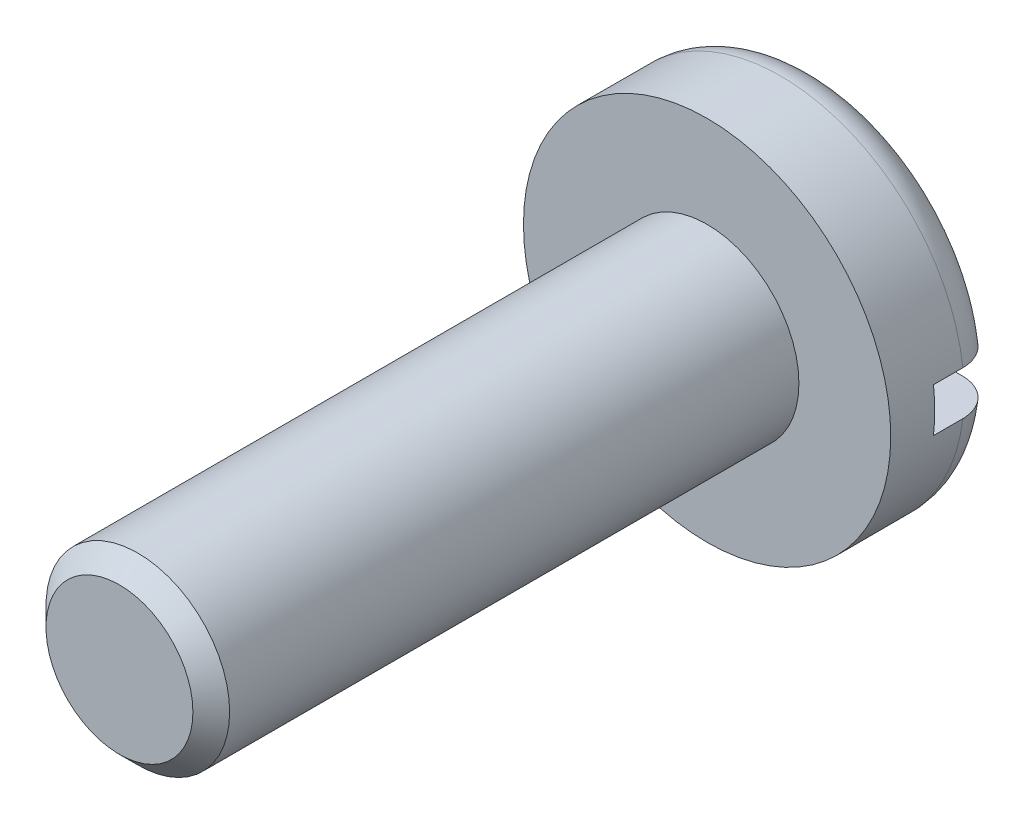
ISO-10303-21;
HEADER;
FILE_DESCRIPTION(('STEP AP214'),'2;1');
FILE_NAME('part.step','',(''),(''),'','','');
FILE_SCHEMA(('AUTOMOTIVE_DESIGN { 1 0 10303 214 1 1 1 1 }'));
ENDSEC;
DATA;
#1=APPLICATION_CONTEXT('core data for automotive mechanical design processes');
#2=APPLICATION_PROTOCOL_DEFINITION('international standard','automotive_design',2000,#1);
#3=PRODUCT_CONTEXT('',#1,'mechanical');
#4=PRODUCT('Part','Part','',(#3));
#5=PRODUCT_RELATED_PRODUCT_CATEGORY('part','',(#4));
#6=PRODUCT_DEFINITION_FORMATION('','',#4);
#7=PRODUCT_DEFINITION_CONTEXT('part definition',#1,'design');
#8=PRODUCT_DEFINITION('design','',#6,#7);
#9=PRODUCT_DEFINITION_SHAPE('','',#8);
#10=(LENGTH_UNIT() NAMED_UNIT(*) SI_UNIT(.MILLI.,.METRE.));
#11=(NAMED_UNIT(*) PLANE_ANGLE_UNIT() SI_UNIT($,.RADIAN.));
#12=(NAMED_UNIT(*) SI_UNIT($,.STERADIAN.) SOLID_ANGLE_UNIT());
#13=UNCERTAINTY_MEASURE_WITH_UNIT(LENGTH_MEASURE(1.E-05),#10,'distance_accuracy_value','');
#14=(GEOMETRIC_REPRESENTATION_CONTEXT(3) GLOBAL_UNCERTAINTY_ASSIGNED_CONTEXT((#13)) GLOBAL_UNIT_ASSIGNED_CONTEXT((#10,
#11,#12)) REPRESENTATION_CONTEXT('',''));
#15=CARTESIAN_POINT('',(0.,0.,0.));
#16=DIRECTION('',(0.,0.,1.));
#17=DIRECTION('',(1.,0.,0.));
#18=AXIS2_PLACEMENT_3D('',#15,#16,#17);
#19=CARTESIAN_POINT('',(0.,0.,-1.5));
#20=DIRECTION('',(0.,0.,1.));
#21=DIRECTION('',(1.,0.,0.));
#22=AXIS2_PLACEMENT_3D('',#19,#20,#21);
#23=PLANE('',#22);
#24=DIRECTION('',(1.,0.,0.));
#25=VECTOR('',#24,1.);
#26=CARTESIAN_POINT('',(-2.5,-0.300000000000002,-1.5));
#27=LINE('',#26,#25);
#28=CARTESIAN_POINT('',(-1.97737199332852,-0.300000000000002,-1.5));
#29=VERTEX_POINT('',#28);
#30=CARTESIAN_POINT('',(1.97737199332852,-0.3,-1.5));
#31=VERTEX_POINT('',#30);
#32=EDGE_CURVE('E162',#29,#31,#27,.T.);
#33=ORIENTED_EDGE('',*,*,#32,.T.);
#34=CARTESIAN_POINT('',(0.,0.,-1.5));
#35=DIRECTION('',(0.,0.,-1.));
#36=DIRECTION('',(-1.,0.,0.));
#37=AXIS2_PLACEMENT_3D('',#34,#35,#36);
#38=CIRCLE('',#37,2.);
#39=EDGE_CURVE('E114',#31,#29,#38,.T.);
#40=ORIENTED_EDGE('',*,*,#39,.T.);
#41=EDGE_LOOP('',(#33,#40));
#42=FACE_BOUND('',#41,.T.);
#43=ADVANCED_FACE('F33',(#42),#23,.F.);
#44=DIRECTION('',(-1.,0.,0.));
#45=VECTOR('',#44,1.);
#46=CARTESIAN_POINT('',(-2.5,0.299999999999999,-1.50000000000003));
#47=LINE('',#46,#45);
#48=CARTESIAN_POINT('',(1.97737199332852,0.3,-1.50000000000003));
#49=VERTEX_POINT('',#48);
#50=CARTESIAN_POINT('',(-1.97737199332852,0.299999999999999,-1.50000000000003));
#51=VERTEX_POINT('',#50);
#52=EDGE_CURVE('E99',#49,#51,#47,.T.);
#53=ORIENTED_EDGE('',*,*,#52,.T.);
#54=EDGE_CURVE('E110',#51,#49,#38,.T.);
#55=ORIENTED_EDGE('',*,*,#54,.T.);
#56=EDGE_LOOP('',(#53,#55));
#57=FACE_BOUND('',#56,.T.);
#58=ADVANCED_FACE('F156',(#57),#23,.F.);
#59=CARTESIAN_POINT('',(0.,0.,-1.00000000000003));
#60=DIRECTION('',(0.,0.,-1.));
#61=DIRECTION('',(-1.,0.,0.));
#62=AXIS2_PLACEMENT_3D('',#59,#60,#61);
#63=TOROIDAL_SURFACE('',#62,2.,0.5);
#64=CARTESIAN_POINT('',(-2.39275623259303,-0.300000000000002,-1.28403566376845));
#65=CARTESIAN_POINT('',(-2.40871742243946,-0.300000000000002,-1.26108979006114));
#66=CARTESIAN_POINT('',(-2.4227591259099,-0.300000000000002,-1.23678491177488));
#67=CARTESIAN_POINT('',(-2.44657688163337,-0.300000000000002,-1.18614419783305));
#68=CARTESIAN_POINT('',(-2.45634810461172,-0.300000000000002,-1.15980610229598));
#69=CARTESIAN_POINT('',(-2.47132091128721,-0.300000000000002,-1.10586746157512));
#70=CARTESIAN_POINT('',(-2.47652391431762,-0.300000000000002,-1.07826731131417));
#71=CARTESIAN_POINT('',(-2.48220908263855,-0.300000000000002,-1.02259204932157));
#72=CARTESIAN_POINT('',(-2.48269236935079,-0.300000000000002,-0.994517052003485));
#73=CARTESIAN_POINT('',(-2.4789314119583,-0.300000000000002,-0.938745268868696));
#74=CARTESIAN_POINT('',(-2.47469714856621,-0.300000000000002,-0.911047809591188));
#75=CARTESIAN_POINT('',(-2.46164113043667,-0.300000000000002,-0.856755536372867));
#76=CARTESIAN_POINT('',(-2.45281923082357,-0.300000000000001,-0.830160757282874));
#77=CARTESIAN_POINT('',(-2.43083915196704,-0.300000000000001,-0.778809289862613));
#78=CARTESIAN_POINT('',(-2.41767832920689,-0.300000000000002,-0.75405373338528));
#79=CARTESIAN_POINT('',(-2.3874045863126,-0.300000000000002,-0.707090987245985));
#80=CARTESIAN_POINT('',(-2.37029161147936,-0.300000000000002,-0.684883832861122));
#81=CARTESIAN_POINT('',(-2.33252347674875,-0.300000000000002,-0.643540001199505));
#82=CARTESIAN_POINT('',(-2.31185310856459,-0.300000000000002,-0.624417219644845));
#83=CARTESIAN_POINT('',(-2.26761601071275,-0.300000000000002,-0.589882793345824));
#84=CARTESIAN_POINT('',(-2.24404918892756,-0.300000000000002,-0.574471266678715));
#85=CARTESIAN_POINT('',(-2.19450129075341,-0.300000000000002,-0.547670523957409));
#86=CARTESIAN_POINT('',(-2.16850345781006,-0.300000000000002,-0.536312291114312));
#87=CARTESIAN_POINT('',(-2.11498123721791,-0.300000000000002,-0.518077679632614));
#88=CARTESIAN_POINT('',(-2.08745677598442,-0.300000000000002,-0.51120151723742));
#89=CARTESIAN_POINT('',(-2.03139586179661,-0.300000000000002,-0.502061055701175));
#90=CARTESIAN_POINT('',(-2.0028524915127,-0.300000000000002,-0.499839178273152));
#91=CARTESIAN_POINT('',(-1.94579410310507,-0.300000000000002,-0.500178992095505));
#92=CARTESIAN_POINT('',(-1.91727908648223,-0.300000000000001,-0.502740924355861));
#93=CARTESIAN_POINT('',(-1.86085138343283,-0.300000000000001,-0.512606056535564));
#94=CARTESIAN_POINT('',(-1.83294512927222,-0.300000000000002,-0.519946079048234));
#95=CARTESIAN_POINT('',(-1.77875489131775,-0.300000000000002,-0.53919591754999));
#96=CARTESIAN_POINT('',(-1.75247096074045,-0.300000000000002,-0.551105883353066));
#97=CARTESIAN_POINT('',(-1.70222054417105,-0.300000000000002,-0.579200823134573));
#98=CARTESIAN_POINT('',(-1.67825918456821,-0.300000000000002,-0.595394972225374));
#99=CARTESIAN_POINT('',(-1.63342077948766,-0.300000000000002,-0.631604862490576));
#100=CARTESIAN_POINT('',(-1.61254366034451,-0.300000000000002,-0.651620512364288));
#101=CARTESIAN_POINT('',(-1.57465426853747,-0.300000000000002,-0.694753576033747));
#102=CARTESIAN_POINT('',(-1.55761348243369,-0.300000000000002,-0.717845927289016));
#103=CARTESIAN_POINT('',(-1.52772834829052,-0.300000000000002,-0.766603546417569));
#104=CARTESIAN_POINT('',(-1.51488357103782,-0.300000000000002,-0.792268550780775));
#105=CARTESIAN_POINT('',(-1.49398926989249,-0.300000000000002,-0.844983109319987));
#106=CARTESIAN_POINT('',(-1.48586286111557,-0.300000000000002,-0.87200218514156));
#107=CARTESIAN_POINT('',(-1.47434461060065,-0.300000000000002,-0.927030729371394));
#108=CARTESIAN_POINT('',(-1.4709522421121,-0.300000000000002,-0.95504008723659));
#109=CARTESIAN_POINT('',(-1.46903184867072,-0.300000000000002,-1.01077570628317));
#110=CARTESIAN_POINT('',(-1.47042704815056,-0.300000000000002,-1.03849935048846));
#111=CARTESIAN_POINT('',(-1.4778655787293,-0.300000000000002,-1.09331475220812));
#112=CARTESIAN_POINT('',(-1.48390879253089,-0.300000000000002,-1.12040652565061));
#113=CARTESIAN_POINT('',(-1.50042579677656,-0.300000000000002,-1.17312973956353));
#114=CARTESIAN_POINT('',(-1.51088885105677,-0.300000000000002,-1.19876454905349));
#115=CARTESIAN_POINT('',(-1.53591625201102,-0.300000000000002,-1.24794598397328));
#116=CARTESIAN_POINT('',(-1.55048084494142,-0.300000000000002,-1.27149248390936));
#117=CARTESIAN_POINT('',(-1.58348986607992,-0.300000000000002,-1.31616342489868));
#118=CARTESIAN_POINT('',(-1.60198226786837,-0.300000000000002,-1.33725240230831));
#119=CARTESIAN_POINT('',(-1.64218916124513,-0.300000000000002,-1.3760946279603));
#120=CARTESIAN_POINT('',(-1.66390395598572,-0.300000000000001,-1.39384756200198));
#121=CARTESIAN_POINT('',(-1.71035693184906,-0.300000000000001,-1.42584129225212));
#122=CARTESIAN_POINT('',(-1.73514201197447,-0.300000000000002,-1.44001401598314));
#123=CARTESIAN_POINT('',(-1.78672025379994,-0.300000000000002,-1.46405146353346));
#124=CARTESIAN_POINT('',(-1.81351355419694,-0.300000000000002,-1.47391588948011));
#125=CARTESIAN_POINT('',(-1.8686735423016,-0.300000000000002,-1.489154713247));
#126=CARTESIAN_POINT('',(-1.89705452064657,-0.300000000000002,-1.49447744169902));
#127=CARTESIAN_POINT('',(-1.95430672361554,-0.300000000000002,-1.50028825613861));
#128=CARTESIAN_POINT('',(-1.98317793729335,-0.300000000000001,-1.50077644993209));
#129=CARTESIAN_POINT('',(-2.04061759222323,-0.300000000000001,-1.49688950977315));
#130=CARTESIAN_POINT('',(-2.06918574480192,-0.300000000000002,-1.49251009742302));
#131=CARTESIAN_POINT('',(-2.12517926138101,-0.300000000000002,-1.47898432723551));
#132=CARTESIAN_POINT('',(-2.15260437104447,-0.300000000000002,-1.46983691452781));
#133=CARTESIAN_POINT('',(-2.20534590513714,-0.300000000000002,-1.44708782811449));
#134=CARTESIAN_POINT('',(-2.23067381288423,-0.300000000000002,-1.43351274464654));
#135=CARTESIAN_POINT('',(-2.27863868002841,-0.300000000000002,-1.40227363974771));
#136=CARTESIAN_POINT('',(-2.30127897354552,-0.3,-1.38461476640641));
#137=CARTESIAN_POINT('',(-2.33540475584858,-0.300000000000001,-1.35296400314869));
#138=CARTESIAN_POINT('',(-2.34790755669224,-0.300000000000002,-1.34005040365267));
#139=CARTESIAN_POINT('',(-2.37145637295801,-0.300000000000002,-1.31295671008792));
#140=CARTESIAN_POINT('',(-2.38250239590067,-0.300000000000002,-1.29877662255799));
#141=CARTESIAN_POINT('',(-2.39275623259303,-0.300000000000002,-1.28403566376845));
#142=B_SPLINE_CURVE_WITH_KNOTS('',3,(#64,#65,#66,#67,#68,#69,#70,#71,#72,#73,#74,#75,#76,#77,
#78,#79,#80,#81,#82,#83,#84,#85,#86,#87,#88,#89,#90,#91,#92,#93,#94,#95,#96,#97,#98,#99,#100,
#101,#102,#103,#104,#105,#106,#107,#108,#109,#110,#111,#112,#113,#114,#115,#116,#117,#118,#119,
#120,#121,#122,#123,#124,#125,#126,#127,#128,#129,#130,#131,#132,#133,#134,#135,#136,#137,#138,
#139,#140,#141),.UNSPECIFIED.,.T.,.F.,(4,2,2,2,2,2,2,2,2,2,2,2,2,2,2,2,2,2,2,2,2,2,2,2,2,2,2,2,
2,2,2,2,2,2,2,2,2,2,4),(0.,0.0837885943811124,0.167671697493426,0.251528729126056,
0.335365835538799,0.419025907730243,0.502688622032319,0.586402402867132,0.670117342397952,
0.754199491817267,0.838284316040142,0.922998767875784,1.00771730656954,1.09320471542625,
1.17869643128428,1.26485492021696,1.35101623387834,1.43736358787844,1.52370887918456,
1.60938950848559,1.69506137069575,1.77929492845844,1.86351911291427,1.94639899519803,
2.02927678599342,2.11195440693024,2.19463699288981,2.27839438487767,2.36215966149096,
2.44741457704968,2.53267538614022,2.61889371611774,2.70511012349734,2.7914023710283,
2.87771371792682,2.96351598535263,3.0492106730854,3.10303867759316,3.15686640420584),.UNSPECIFIED.);
#143=CARTESIAN_POINT('',(-2.48193472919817,-0.300000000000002,-1.));
#144=VERTEX_POINT('',#143);
#145=EDGE_CURVE('E54',#29,#144,#142,.T.);
#146=ORIENTED_EDGE('',*,*,#145,.F.);
#147=ORIENTED_EDGE('',*,*,#39,.F.);
#148=CARTESIAN_POINT('',(1.51295371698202,-0.300000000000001,-1.20152293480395));
#149=CARTESIAN_POINT('',(1.50164195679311,-0.300000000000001,-1.17632539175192));
#150=CARTESIAN_POINT('',(1.49243193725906,-0.300000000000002,-1.15016423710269));
#151=CARTESIAN_POINT('',(1.47852371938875,-0.300000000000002,-1.09664823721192));
#152=CARTESIAN_POINT('',(1.47383003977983,-0.300000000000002,-1.06929222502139));
#153=CARTESIAN_POINT('',(1.46911958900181,-0.300000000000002,-1.01418191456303));
#154=CARTESIAN_POINT('',(1.46910208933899,-0.300000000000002,-0.986427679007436));
#155=CARTESIAN_POINT('',(1.47374385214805,-0.300000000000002,-0.93132004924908));
#156=CARTESIAN_POINT('',(1.47840213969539,-0.300000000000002,-0.903966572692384));
#157=CARTESIAN_POINT('',(1.49222068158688,-0.300000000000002,-0.850505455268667));
#158=CARTESIAN_POINT('',(1.50136823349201,-0.300000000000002,-0.824394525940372));
#159=CARTESIAN_POINT('',(1.52387003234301,-0.300000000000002,-0.77405333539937));
#160=CARTESIAN_POINT('',(1.53722462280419,-0.300000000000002,-0.749823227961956));
#161=CARTESIAN_POINT('',(1.56790637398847,-0.300000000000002,-0.703634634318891));
#162=CARTESIAN_POINT('',(1.58527611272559,-0.300000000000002,-0.681704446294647));
#163=CARTESIAN_POINT('',(1.62339117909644,-0.300000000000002,-0.641006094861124));
#164=CARTESIAN_POINT('',(1.64413681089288,-0.300000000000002,-0.622238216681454));
#165=CARTESIAN_POINT('',(1.68881591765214,-0.300000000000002,-0.58804493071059));
#166=CARTESIAN_POINT('',(1.7127998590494,-0.300000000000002,-0.572685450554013));
#167=CARTESIAN_POINT('',(1.76298083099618,-0.300000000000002,-0.546151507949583));
#168=CARTESIAN_POINT('',(1.7891780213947,-0.300000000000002,-0.534977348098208));
#169=CARTESIAN_POINT('',(1.8434013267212,-0.300000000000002,-0.51699982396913));
#170=CARTESIAN_POINT('',(1.87144638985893,-0.300000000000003,-0.510253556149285));
#171=CARTESIAN_POINT('',(1.92827077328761,-0.300000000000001,-0.501551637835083));
#172=CARTESIAN_POINT('',(1.95705011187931,-0.3,-0.499596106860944));
#173=CARTESIAN_POINT('',(2.01460044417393,-0.3,-0.500543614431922));
#174=CARTESIAN_POINT('',(2.04337124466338,-0.300000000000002,-0.503458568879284));
#175=CARTESIAN_POINT('',(2.1000081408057,-0.300000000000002,-0.514104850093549));
#176=CARTESIAN_POINT('',(2.12787425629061,-0.3,-0.521836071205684));
#177=CARTESIAN_POINT('',(2.18174184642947,-0.3,-0.541856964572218));
#178=CARTESIAN_POINT('',(2.20775283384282,-0.300000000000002,-0.554121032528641));
#179=CARTESIAN_POINT('',(2.25732057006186,-0.300000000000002,-0.582880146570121));
#180=CARTESIAN_POINT('',(2.28087742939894,-0.300000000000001,-0.599375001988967));
#181=CARTESIAN_POINT('',(2.32464265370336,-0.300000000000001,-0.635969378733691));
#182=CARTESIAN_POINT('',(2.34487911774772,-0.300000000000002,-0.656035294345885));
#183=CARTESIAN_POINT('',(2.38166035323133,-0.300000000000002,-0.699305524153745));
#184=CARTESIAN_POINT('',(2.39820529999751,-0.300000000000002,-0.72250968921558));
#185=CARTESIAN_POINT('',(2.42698667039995,-0.300000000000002,-0.771182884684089));
#186=CARTESIAN_POINT('',(2.43925877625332,-0.300000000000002,-0.796630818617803));
#187=CARTESIAN_POINT('',(2.45932706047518,-0.300000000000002,-0.849234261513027));
#188=CARTESIAN_POINT('',(2.46712340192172,-0.300000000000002,-0.876389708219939));
#189=CARTESIAN_POINT('',(2.47797597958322,-0.300000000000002,-0.931462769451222));
#190=CARTESIAN_POINT('',(2.48106025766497,-0.300000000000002,-0.95937486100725));
#191=CARTESIAN_POINT('',(2.48248663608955,-0.300000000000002,-1.01531971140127));
#192=CARTESIAN_POINT('',(2.48082882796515,-0.300000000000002,-1.04335246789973));
#193=CARTESIAN_POINT('',(2.47282971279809,-0.300000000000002,-1.09867291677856));
#194=CARTESIAN_POINT('',(2.46649956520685,-0.300000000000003,-1.12596222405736));
#195=CARTESIAN_POINT('',(2.44935421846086,-0.300000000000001,-1.17909306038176));
#196=CARTESIAN_POINT('',(2.43853901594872,-0.3,-1.20493458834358));
#197=CARTESIAN_POINT('',(2.4127193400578,-0.3,-1.25448123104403));
#198=CARTESIAN_POINT('',(2.39770859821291,-0.300000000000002,-1.27818307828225));
#199=CARTESIAN_POINT('',(2.36394008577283,-0.300000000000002,-1.32274666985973));
#200=CARTESIAN_POINT('',(2.34518224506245,-0.3,-1.3436083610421));
#201=CARTESIAN_POINT('',(2.3043522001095,-0.3,-1.38201875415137));
#202=CARTESIAN_POINT('',(2.28226337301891,-0.300000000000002,-1.39954978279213));
#203=CARTESIAN_POINT('',(2.23547558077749,-0.300000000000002,-1.43068910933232));
#204=CARTESIAN_POINT('',(2.21077651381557,-0.3,-1.44429725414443));
#205=CARTESIAN_POINT('',(2.15925900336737,-0.3,-1.46732332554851));
#206=CARTESIAN_POINT('',(2.13242515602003,-0.300000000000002,-1.4767067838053));
#207=CARTESIAN_POINT('',(2.07757090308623,-0.300000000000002,-1.49088058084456));
#208=CARTESIAN_POINT('',(2.04955043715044,-0.300000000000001,-1.49567068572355));
#209=CARTESIAN_POINT('',(1.99284573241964,-0.300000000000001,-1.50056541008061));
#210=CARTESIAN_POINT('',(1.96415777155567,-0.300000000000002,-1.50062692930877));
#211=CARTESIAN_POINT('',(1.90717349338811,-0.300000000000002,-1.49596835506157));
#212=CARTESIAN_POINT('',(1.87887718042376,-0.300000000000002,-1.49124820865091));
#213=CARTESIAN_POINT('',(1.82327468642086,-0.300000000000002,-1.47711555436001));
#214=CARTESIAN_POINT('',(1.79597660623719,-0.300000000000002,-1.46767115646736));
#215=CARTESIAN_POINT('',(1.74334396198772,-0.300000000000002,-1.44433233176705));
#216=CARTESIAN_POINT('',(1.71800992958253,-0.300000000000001,-1.43043670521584));
#217=CARTESIAN_POINT('',(1.67002830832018,-0.300000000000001,-1.39856652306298));
#218=CARTESIAN_POINT('',(1.64738261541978,-0.300000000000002,-1.38058911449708));
#219=CARTESIAN_POINT('',(1.6054902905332,-0.300000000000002,-1.34106460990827));
#220=CARTESIAN_POINT('',(1.58623945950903,-0.3,-1.31952198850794));
#221=CARTESIAN_POINT('',(1.55792919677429,-0.300000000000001,-1.28177033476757));
#222=CARTESIAN_POINT('',(1.54769403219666,-0.300000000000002,-1.26642830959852));
#223=CARTESIAN_POINT('',(1.52897880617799,-0.300000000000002,-1.23470806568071));
#224=CARTESIAN_POINT('',(1.52049873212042,-0.300000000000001,-1.21832985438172));
#225=CARTESIAN_POINT('',(1.51295371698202,-0.300000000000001,-1.20152293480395));
#226=B_SPLINE_CURVE_WITH_KNOTS('',3,(#148,#149,#150,#151,#152,#153,#154,#155,#156,#157,#158,
#159,#160,#161,#162,#163,#164,#165,#166,#167,#168,#169,#170,#171,#172,#173,#174,#175,#176,#177,
#178,#179,#180,#181,#182,#183,#184,#185,#186,#187,#188,#189,#190,#191,#192,#193,#194,#195,#196,
#197,#198,#199,#200,#201,#202,#203,#204,#205,#206,#207,#208,#209,#210,#211,#212,#213,#214,#215,
#216,#217,#218,#219,#220,#221,#222,#223,#224,#225),.UNSPECIFIED.,.T.,.F.,(4,2,2,2,2,2,2,2,2,2,2,
2,2,2,2,2,2,2,2,2,2,2,2,2,2,2,2,2,2,2,2,2,2,2,2,2,2,2,4),(0.,0.0827941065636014,
0.165670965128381,0.248534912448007,0.331381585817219,0.413995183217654,0.496615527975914,
0.580155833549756,0.663703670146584,0.748748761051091,0.833799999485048,0.919927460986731,
1.00605707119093,1.0923977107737,1.17873645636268,1.26459478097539,1.35044923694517,
1.43553479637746,1.52061631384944,1.60496924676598,1.68931910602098,1.77316500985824,
1.8570092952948,1.94065397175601,2.02429871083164,2.10806909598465,2.19184104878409,
2.27604580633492,2.36025384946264,2.44513700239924,2.53002447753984,2.61568559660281,
2.70134766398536,2.78759593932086,2.87386748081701,2.96019950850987,3.04642399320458,
3.10164857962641,3.1568727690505),.UNSPECIFIED.);
#227=CARTESIAN_POINT('',(2.48193472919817,-0.300000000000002,-1.));
#228=VERTEX_POINT('',#227);
#229=EDGE_CURVE('E126',#228,#31,#226,.T.);
#230=ORIENTED_EDGE('',*,*,#229,.F.);
#231=CARTESIAN_POINT('',(0.,0.,-1.00000000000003));
#232=DIRECTION('',(0.,0.,-1.));
#233=DIRECTION('',(-1.,0.,0.));
#234=AXIS2_PLACEMENT_3D('',#231,#232,#233);
#235=CIRCLE('',#234,2.5);
#236=EDGE_CURVE('E121',#228,#144,#235,.T.);
#237=ORIENTED_EDGE('',*,*,#236,.T.);
#238=EDGE_LOOP('',(#146,#147,#230,#237));
#239=FACE_BOUND('',#238,.T.);
#240=ADVANCED_FACE('F134',(#239),#63,.T.);
#241=CARTESIAN_POINT('',(-2.39275623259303,0.299999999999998,-1.28403566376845));
#242=CARTESIAN_POINT('',(-2.3766366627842,0.299999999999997,-1.30720477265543));
#243=CARTESIAN_POINT('',(-2.35853609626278,0.299999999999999,-1.3290219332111));
#244=CARTESIAN_POINT('',(-2.31890561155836,0.300000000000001,-1.36931696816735));
#245=CARTESIAN_POINT('',(-2.29737130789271,0.3,-1.38779050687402));
#246=CARTESIAN_POINT('',(-2.25152834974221,0.3,-1.42085294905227));
#247=CARTESIAN_POINT('',(-2.22722204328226,0.3,-1.43544510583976));
#248=CARTESIAN_POINT('',(-2.17652432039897,0.299999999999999,-1.46036713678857));
#249=CARTESIAN_POINT('',(-2.15013341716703,0.299999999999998,-1.47069805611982));
#250=CARTESIAN_POINT('',(-2.09582564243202,0.299999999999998,-1.48688942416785));
#251=CARTESIAN_POINT('',(-2.06789989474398,0.299999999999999,-1.49272009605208));
#252=CARTESIAN_POINT('',(-2.01146649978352,0.3,-1.49965496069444));
#253=CARTESIAN_POINT('',(-1.98295879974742,0.3,-1.50075872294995));
#254=CARTESIAN_POINT('',(-1.92590693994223,0.3,-1.49821232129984));
#255=CARTESIAN_POINT('',(-1.8973646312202,0.3,-1.49452060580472));
#256=CARTESIAN_POINT('',(-1.84129666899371,0.3,-1.48242263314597));
#257=CARTESIAN_POINT('',(-1.81377105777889,0.299999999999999,-1.47401618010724));
#258=CARTESIAN_POINT('',(-1.76037992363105,0.299999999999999,-1.45266949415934));
#259=CARTESIAN_POINT('',(-1.73452319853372,0.3,-1.43970724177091));
#260=CARTESIAN_POINT('',(-1.6853618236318,0.3,-1.40961139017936));
#261=CARTESIAN_POINT('',(-1.6620571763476,0.3,-1.39247778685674));
#262=CARTESIAN_POINT('',(-1.61876589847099,0.3,-1.35457576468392));
#263=CARTESIAN_POINT('',(-1.59876763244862,0.3,-1.333820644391));
#264=CARTESIAN_POINT('',(-1.56259822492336,0.3,-1.28920623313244));
#265=CARTESIAN_POINT('',(-1.54642680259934,0.299999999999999,-1.26534717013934));
#266=CARTESIAN_POINT('',(-1.51862309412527,0.299999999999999,-1.21555278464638));
#267=CARTESIAN_POINT('',(-1.50693057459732,0.3,-1.18965110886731));
#268=CARTESIAN_POINT('',(-1.48815094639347,0.3,-1.13622899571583));
#269=CARTESIAN_POINT('',(-1.48106327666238,0.3,-1.10870875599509));
#270=CARTESIAN_POINT('',(-1.4718163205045,0.3,-1.0533607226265));
#271=CARTESIAN_POINT('',(-1.46957093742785,0.3,-1.02554729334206));
#272=CARTESIAN_POINT('',(-1.46982713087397,0.3,-0.969943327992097));
#273=CARTESIAN_POINT('',(-1.47232840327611,0.299999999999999,-0.942152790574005));
#274=CARTESIAN_POINT('',(-1.48195137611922,0.299999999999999,-0.887634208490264));
#275=CARTESIAN_POINT('',(-1.48903285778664,0.3,-0.860899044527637));
#276=CARTESIAN_POINT('',(-1.50754942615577,0.3,-0.808982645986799));
#277=CARTESIAN_POINT('',(-1.51898465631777,0.3,-0.78380146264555));
#278=CARTESIAN_POINT('',(-1.54596094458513,0.3,-0.735485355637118));
#279=CARTESIAN_POINT('',(-1.56153353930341,0.3,-0.7123680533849));
#280=CARTESIAN_POINT('',(-1.59627591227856,0.3,-0.669017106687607));
#281=CARTESIAN_POINT('',(-1.61544600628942,0.299999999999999,-0.648783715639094));
#282=CARTESIAN_POINT('',(-1.65719975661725,0.299999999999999,-0.611398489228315));
#283=CARTESIAN_POINT('',(-1.67983740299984,0.3,-0.594306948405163));
#284=CARTESIAN_POINT('',(-1.72762667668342,0.3,-0.56410115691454));
#285=CARTESIAN_POINT('',(-1.75277850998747,0.3,-0.55098723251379));
#286=CARTESIAN_POINT('',(-1.80528190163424,0.3,-0.52892175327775));
#287=CARTESIAN_POINT('',(-1.83266027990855,0.3,-0.520033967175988));
#288=CARTESIAN_POINT('',(-1.88851740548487,0.299999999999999,-0.506955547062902));
#289=CARTESIAN_POINT('',(-1.91699619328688,0.299999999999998,-0.502765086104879));
#290=CARTESIAN_POINT('',(-1.97439273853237,0.299999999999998,-0.499197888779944));
#291=CARTESIAN_POINT('',(-2.00331194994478,0.299999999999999,-0.499844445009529));
#292=CARTESIAN_POINT('',(-2.06062804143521,0.3,-0.506003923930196));
#293=CARTESIAN_POINT('',(-2.08902492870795,0.3,-0.511516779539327));
#294=CARTESIAN_POINT('',(-2.14436262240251,0.3,-0.527238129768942));
#295=CARTESIAN_POINT('',(-2.17130892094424,0.3,-0.537427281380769));
#296=CARTESIAN_POINT('',(-2.22308657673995,0.3,-0.562223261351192));
#297=CARTESIAN_POINT('',(-2.24791801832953,0.299999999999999,-0.576829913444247));
#298=CARTESIAN_POINT('',(-2.29453266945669,0.3,-0.609913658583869));
#299=CARTESIAN_POINT('',(-2.31634016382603,0.3,-0.628356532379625));
#300=CARTESIAN_POINT('',(-2.35651448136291,0.3,-0.668671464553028));
#301=CARTESIAN_POINT('',(-2.37488146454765,0.299999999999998,-0.690543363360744));
#302=CARTESIAN_POINT('',(-2.4074821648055,0.299999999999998,-0.73688533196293));
#303=CARTESIAN_POINT('',(-2.42175116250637,0.299999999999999,-0.761330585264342));
#304=CARTESIAN_POINT('',(-2.44594990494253,0.3,-0.812280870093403));
#305=CARTESIAN_POINT('',(-2.45587999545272,0.3,-0.838785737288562));
#306=CARTESIAN_POINT('',(-2.47105459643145,0.3,-0.892909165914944));
#307=CARTESIAN_POINT('',(-2.47633053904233,0.3,-0.920518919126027));
#308=CARTESIAN_POINT('',(-2.48215636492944,0.299999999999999,-0.976240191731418));
#309=CARTESIAN_POINT('',(-2.48270516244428,0.299999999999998,-1.00435182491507));
#310=CARTESIAN_POINT('',(-2.47906445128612,0.299999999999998,-1.06018488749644));
#311=CARTESIAN_POINT('',(-2.47488810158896,0.3,-1.08790718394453));
#312=CARTESIAN_POINT('',(-2.46194244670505,0.3,-1.1422328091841));
#313=CARTESIAN_POINT('',(-2.45317878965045,0.299999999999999,-1.16883747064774));
#314=CARTESIAN_POINT('',(-2.43557271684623,0.299999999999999,-1.21022598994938));
#315=CARTESIAN_POINT('',(-2.42807592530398,0.3,-1.22559659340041));
#316=CARTESIAN_POINT('',(-2.41154682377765,0.3,-1.25548850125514));
#317=CARTESIAN_POINT('',(-2.40251451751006,0.299999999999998,-1.27000980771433));
#318=CARTESIAN_POINT('',(-2.39275623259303,0.299999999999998,-1.28403566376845));
#319=B_SPLINE_CURVE_WITH_KNOTS('',3,(#241,#242,#243,#244,#245,#246,#247,#248,#249,#250,#251,
#252,#253,#254,#255,#256,#257,#258,#259,#260,#261,#262,#263,#264,#265,#266,#267,#268,#269,#270,
#271,#272,#273,#274,#275,#276,#277,#278,#279,#280,#281,#282,#283,#284,#285,#286,#287,#288,#289,
#290,#291,#292,#293,#294,#295,#296,#297,#298,#299,#300,#301,#302,#303,#304,#305,#306,#307,#308,
#309,#310,#311,#312,#313,#314,#315,#316,#317,#318),.UNSPECIFIED.,.T.,.F.,(4,2,2,2,2,2,2,2,2,2,2,
2,2,2,2,2,2,2,2,2,2,2,2,2,2,2,2,2,2,2,2,2,2,2,2,2,2,2,4),(0.,0.0846118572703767,
0.169332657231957,0.253982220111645,0.338611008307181,0.423795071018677,0.508986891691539,
0.594921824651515,0.680860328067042,0.76722004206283,0.853579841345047,0.939628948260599,
1.02567173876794,1.11051298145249,1.19534388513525,1.27865360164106,1.36195798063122,
1.4445406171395,1.52712597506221,1.61035984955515,1.69360103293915,1.77830268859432,
1.86301129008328,1.94896041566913,2.03491270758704,2.12127916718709,2.20764443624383,
2.29365564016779,2.37966341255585,2.46493458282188,2.55020178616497,2.63471124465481,
2.71921396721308,2.80314152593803,2.88708836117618,2.97080198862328,3.05441278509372,
3.10563428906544,3.15685566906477),.UNSPECIFIED.);
#320=CARTESIAN_POINT('',(-2.48193472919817,0.3,-1.));
#321=VERTEX_POINT('',#320);
#322=EDGE_CURVE('E167',#321,#51,#319,.T.);
#323=ORIENTED_EDGE('',*,*,#322,.F.);
#324=CARTESIAN_POINT('',(2.48193472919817,0.299999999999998,-1.));
#325=VERTEX_POINT('',#324);
#326=EDGE_CURVE('E119',#321,#325,#235,.T.);
#327=ORIENTED_EDGE('',*,*,#326,.T.);
#328=CARTESIAN_POINT('',(1.51295371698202,0.3,-1.20152293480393));
#329=CARTESIAN_POINT('',(1.52452760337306,0.3,-1.22729808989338));
#330=CARTESIAN_POINT('',(1.53831827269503,0.3,-1.25210269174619));
#331=CARTESIAN_POINT('',(1.56989783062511,0.299999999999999,-1.29905284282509));
#332=CARTESIAN_POINT('',(1.58769235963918,0.299999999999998,-1.32119457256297));
#333=CARTESIAN_POINT('',(1.62670934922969,0.299999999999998,-1.36216736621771));
#334=CARTESIAN_POINT('',(1.64792762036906,0.299999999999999,-1.38100241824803));
#335=CARTESIAN_POINT('',(1.69318518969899,0.3,-1.41488822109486));
#336=CARTESIAN_POINT('',(1.71722377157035,0.3,-1.42993992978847));
#337=CARTESIAN_POINT('',(1.76775652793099,0.3,-1.45602798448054));
#338=CARTESIAN_POINT('',(1.79427671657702,0.3,-1.46701395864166));
#339=CARTESIAN_POINT('',(1.8487782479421,0.3,-1.48441559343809));
#340=CARTESIAN_POINT('',(1.87675972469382,0.3,-1.49083083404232));
#341=CARTESIAN_POINT('',(1.93360878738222,0.3,-1.49893788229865));
#342=CARTESIAN_POINT('',(1.96248135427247,0.3,-1.50059483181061));
#343=CARTESIAN_POINT('',(2.02009421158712,0.3,-1.49902645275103));
#344=CARTESIAN_POINT('',(2.04883450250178,0.299999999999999,-1.49580114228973));
#345=CARTESIAN_POINT('',(2.10529197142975,0.3,-1.48455545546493));
#346=CARTESIAN_POINT('',(2.13301139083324,0.3,-1.47654634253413));
#347=CARTESIAN_POINT('',(2.18669482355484,0.3,-1.45595107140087));
#348=CARTESIAN_POINT('',(2.21265890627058,0.299999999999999,-1.44336509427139));
#349=CARTESIAN_POINT('',(2.26187268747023,0.299999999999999,-1.4140772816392));
#350=CARTESIAN_POINT('',(2.28514227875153,0.3,-1.39740887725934));
#351=CARTESIAN_POINT('',(2.32851967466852,0.3,-1.36036870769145));
#352=CARTESIAN_POINT('',(2.3486276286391,0.3,-1.33999711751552));
#353=CARTESIAN_POINT('',(2.38491736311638,0.299999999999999,-1.29632933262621));
#354=CARTESIAN_POINT('',(2.40113325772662,0.3,-1.27306148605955));
#355=CARTESIAN_POINT('',(2.42939438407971,0.3,-1.22411745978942));
#356=CARTESIAN_POINT('',(2.44143979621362,0.3,-1.19844138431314));
#357=CARTESIAN_POINT('',(2.46092908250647,0.3,-1.14561409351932));
#358=CARTESIAN_POINT('',(2.46840622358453,0.3,-1.11847514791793));
#359=CARTESIAN_POINT('',(2.47867699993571,0.3,-1.06332515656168));
#360=CARTESIAN_POINT('',(2.48147076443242,0.3,-1.03531413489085));
#361=CARTESIAN_POINT('',(2.48229055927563,0.3,-0.979338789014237));
#362=CARTESIAN_POINT('',(2.48033625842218,0.3,-0.951374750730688));
#363=CARTESIAN_POINT('',(2.47175867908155,0.3,-0.896172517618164));
#364=CARTESIAN_POINT('',(2.46513544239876,0.3,-0.868934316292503));
#365=CARTESIAN_POINT('',(2.44741716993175,0.3,-0.815963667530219));
#366=CARTESIAN_POINT('',(2.43632356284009,0.3,-0.790230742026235));
#367=CARTESIAN_POINT('',(2.40998810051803,0.3,-0.740983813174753));
#368=CARTESIAN_POINT('',(2.39474620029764,0.299999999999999,-0.717469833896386));
#369=CARTESIAN_POINT('',(2.36049462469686,0.299999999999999,-0.67323606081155));
#370=CARTESIAN_POINT('',(2.34147191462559,0.3,-0.652526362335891));
#371=CARTESIAN_POINT('',(2.30024067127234,0.3,-0.614568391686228));
#372=CARTESIAN_POINT('',(2.27803204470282,0.299999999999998,-0.597320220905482));
#373=CARTESIAN_POINT('',(2.23089955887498,0.299999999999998,-0.566645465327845));
#374=CARTESIAN_POINT('',(2.20595818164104,0.3,-0.553245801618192));
#375=CARTESIAN_POINT('',(2.15419440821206,0.3,-0.530782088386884));
#376=CARTESIAN_POINT('',(2.12737192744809,0.299999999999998,-0.521718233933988));
#377=CARTESIAN_POINT('',(2.07235272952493,0.299999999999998,-0.508097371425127));
#378=CARTESIAN_POINT('',(2.0441459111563,0.299999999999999,-0.503581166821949));
#379=CARTESIAN_POINT('',(1.98737407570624,0.3,-0.499305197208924));
#380=CARTESIAN_POINT('',(1.95880904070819,0.3,-0.49954567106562));
#381=CARTESIAN_POINT('',(1.90187459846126,0.3,-0.504785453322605));
#382=CARTESIAN_POINT('',(1.87350889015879,0.3,-0.509825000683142));
#383=CARTESIAN_POINT('',(1.81801805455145,0.3,-0.524574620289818));
#384=CARTESIAN_POINT('',(1.79089297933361,0.299999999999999,-0.534284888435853));
#385=CARTESIAN_POINT('',(1.73854574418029,0.299999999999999,-0.558156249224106));
#386=CARTESIAN_POINT('',(1.71333157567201,0.3,-0.572334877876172));
#387=CARTESIAN_POINT('',(1.66565582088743,0.3,-0.604743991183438));
#388=CARTESIAN_POINT('',(1.6431942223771,0.3,-0.622974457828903));
#389=CARTESIAN_POINT('',(1.60179845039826,0.3,-0.662886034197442));
#390=CARTESIAN_POINT('',(1.58284699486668,0.3,-0.684549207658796));
#391=CARTESIAN_POINT('',(1.54891708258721,0.3,-0.730790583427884));
#392=CARTESIAN_POINT('',(1.53393812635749,0.3,-0.75536841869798));
#393=CARTESIAN_POINT('',(1.50863022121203,0.3,-0.806344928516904));
#394=CARTESIAN_POINT('',(1.49823384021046,0.3,-0.832710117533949));
#395=CARTESIAN_POINT('',(1.48210216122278,0.3,-0.886837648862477));
#396=CARTESIAN_POINT('',(1.47636750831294,0.3,-0.914600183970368));
#397=CARTESIAN_POINT('',(1.46981262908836,0.3,-0.970217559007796));
#398=CARTESIAN_POINT('',(1.46891064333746,0.3,-0.998062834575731));
#399=CARTESIAN_POINT('',(1.47183363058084,0.3,-1.05347947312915));
#400=CARTESIAN_POINT('',(1.47565247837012,0.299999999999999,-1.08105114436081));
#401=CARTESIAN_POINT('',(1.48538142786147,0.3,-1.12413018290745));
#402=CARTESIAN_POINT('',(1.48981103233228,0.3,-1.13998694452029));
#403=CARTESIAN_POINT('',(1.50022785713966,0.3,-1.1711797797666));
#404=CARTESIAN_POINT('',(1.5062150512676,0.3,-1.18651586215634));
#405=CARTESIAN_POINT('',(1.51295371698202,0.3,-1.20152293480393));
#406=B_SPLINE_CURVE_WITH_KNOTS('',3,(#328,#329,#330,#331,#332,#333,#334,#335,#336,#337,#338,
#339,#340,#341,#342,#343,#344,#345,#346,#347,#348,#349,#350,#351,#352,#353,#354,#355,#356,#357,
#358,#359,#360,#361,#362,#363,#364,#365,#366,#367,#368,#369,#370,#371,#372,#373,#374,#375,#376,
#377,#378,#379,#380,#381,#382,#383,#384,#385,#386,#387,#388,#389,#390,#391,#392,#393,#394,#395,
#396,#397,#398,#399,#400,#401,#402,#403,#404,#405),.UNSPECIFIED.,.T.,.F.,(4,2,2,2,2,2,2,2,2,2,2,
2,2,2,2,2,2,2,2,2,2,2,2,2,2,2,2,2,2,2,2,2,2,2,2,2,2,2,4),(0.,0.0847019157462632,
0.169523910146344,0.254242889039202,0.33894039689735,0.424654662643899,0.510376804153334,
0.596725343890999,0.683073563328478,0.769219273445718,0.855361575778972,0.940820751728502,
1.02627588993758,1.11095216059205,1.19562476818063,1.27967318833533,1.36371928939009,
1.4474178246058,1.53111561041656,1.61478666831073,1.69845863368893,1.78242423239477,
1.86639229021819,1.95093416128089,2.0354798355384,2.12077750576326,2.20607945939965,
2.29210300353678,2.3781301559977,2.46449921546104,2.55086789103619,2.63679932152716,
2.72271994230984,2.8073302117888,2.89195218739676,2.97513789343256,3.05821578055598,
3.10753262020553,3.15684863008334),.UNSPECIFIED.);
#407=EDGE_CURVE('E168',#49,#325,#406,.T.);
#408=ORIENTED_EDGE('',*,*,#407,.F.);
#409=ORIENTED_EDGE('',*,*,#54,.F.);
#410=EDGE_LOOP('',(#323,#327,#408,#409));
#411=FACE_BOUND('',#410,.T.);
#412=ADVANCED_FACE('F149',(#411),#63,.T.);
#413=CARTESIAN_POINT('',(0.,0.,0.));
#414=DIRECTION('',(0.,0.,-1.));
#415=DIRECTION('',(-1.,0.,0.));
#416=AXIS2_PLACEMENT_3D('',#413,#414,#415);
#417=CYLINDRICAL_SURFACE('',#416,2.5);
#418=CARTESIAN_POINT('',(0.,0.,0.));
#419=DIRECTION('',(0.,0.,-1.));
#420=DIRECTION('',(-1.,0.,0.));
#421=AXIS2_PLACEMENT_3D('',#418,#419,#420);
#422=CIRCLE('',#421,2.5);
#423=CARTESIAN_POINT('',(-2.5,0.,0.));
#424=VERTEX_POINT('',#423);
#425=EDGE_CURVE('E123',#424,#424,#422,.T.);
#426=ORIENTED_EDGE('',*,*,#425,.T.);
#427=EDGE_LOOP('',(#426));
#428=FACE_BOUND('',#427,.T.);
#429=DIRECTION('',(0.,0.,-1.));
#430=VECTOR('',#429,1.);
#431=CARTESIAN_POINT('',(-2.48193472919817,-0.300000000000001,0.));
#432=LINE('',#431,#430);
#433=CARTESIAN_POINT('',(-2.48193472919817,-0.300000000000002,-0.599999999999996));
#434=VERTEX_POINT('',#433);
#435=EDGE_CURVE('E82',#144,#434,#432,.F.);
#436=ORIENTED_EDGE('',*,*,#435,.F.);
#437=ORIENTED_EDGE('',*,*,#236,.F.);
#438=DIRECTION('',(0.,0.,-1.));
#439=VECTOR('',#438,1.);
#440=CARTESIAN_POINT('',(2.48193472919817,-0.300000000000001,0.));
#441=LINE('',#440,#439);
#442=CARTESIAN_POINT('',(2.48193472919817,-0.300000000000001,-0.600000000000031));
#443=VERTEX_POINT('',#442);
#444=EDGE_CURVE('E47',#443,#228,#441,.T.);
#445=ORIENTED_EDGE('',*,*,#444,.F.);
#446=CARTESIAN_POINT('',(0.,0.,-0.600000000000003));
#447=DIRECTION('',(0.,0.,1.));
#448=DIRECTION('',(1.,0.,0.));
#449=AXIS2_PLACEMENT_3D('',#446,#447,#448);
#450=CIRCLE('',#449,2.5);
#451=CARTESIAN_POINT('',(2.48193472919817,0.299999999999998,-0.600000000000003));
#452=VERTEX_POINT('',#451);
#453=EDGE_CURVE('E97',#443,#452,#450,.T.);
#454=ORIENTED_EDGE('',*,*,#453,.T.);
#455=DIRECTION('',(0.,0.,-1.));
#456=VECTOR('',#455,1.);
#457=CARTESIAN_POINT('',(2.48193472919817,0.299999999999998,0.));
#458=LINE('',#457,#456);
#459=EDGE_CURVE('E106',#325,#452,#458,.F.);
#460=ORIENTED_EDGE('',*,*,#459,.F.);
#461=ORIENTED_EDGE('',*,*,#326,.F.);
#462=DIRECTION('',(0.,0.,-1.));
#463=VECTOR('',#462,1.);
#464=CARTESIAN_POINT('',(-2.48193472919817,0.3,0.));
#465=LINE('',#464,#463);
#466=CARTESIAN_POINT('',(-2.48193472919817,0.3,-0.600000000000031));
#467=VERTEX_POINT('',#466);
#468=EDGE_CURVE('E90',#467,#321,#465,.T.);
#469=ORIENTED_EDGE('',*,*,#468,.F.);
#470=EDGE_CURVE('E95',#467,#434,#450,.T.);
#471=ORIENTED_EDGE('',*,*,#470,.T.);
#472=EDGE_LOOP('',(#436,#437,#445,#454,#460,#461,#469,#471));
#473=FACE_BOUND('',#472,.T.);
#474=ADVANCED_FACE('F102',(#428,#473),#417,.T.);
#475=CARTESIAN_POINT('',(0.,0.,0.));
#476=DIRECTION('',(0.,0.,-1.));
#477=DIRECTION('',(-1.,0.,0.));
#478=AXIS2_PLACEMENT_3D('',#475,#476,#477);
#479=PLANE('',#478);
#480=CARTESIAN_POINT('',(0.,0.,0.));
#481=DIRECTION('',(0.,0.,1.));
#482=DIRECTION('',(1.,0.,0.));
#483=AXIS2_PLACEMENT_3D('',#480,#481,#482);
#484=CIRCLE('',#483,1.25);
#485=CARTESIAN_POINT('',(1.25,0.,0.));
#486=VERTEX_POINT('',#485);
#487=EDGE_CURVE('E164',#486,#486,#484,.T.);
#488=ORIENTED_EDGE('',*,*,#487,.F.);
#489=EDGE_LOOP('',(#488));
#490=FACE_BOUND('',#489,.T.);
#491=ORIENTED_EDGE('',*,*,#425,.F.);
#492=EDGE_LOOP('',(#491));
#493=FACE_BOUND('',#492,.T.);
#494=ADVANCED_FACE('F142',(#490,#493),#479,.F.);
#495=CARTESIAN_POINT('',(-2.5,-0.300000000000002,-0.599999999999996));
#496=DIRECTION('',(0.,1.,0.));
#497=DIRECTION('',(0.,0.,1.));
#498=AXIS2_PLACEMENT_3D('',#495,#496,#497);
#499=PLANE('',#498);
#500=ORIENTED_EDGE('',*,*,#229,.T.);
#501=ORIENTED_EDGE('',*,*,#32,.F.);
#502=ORIENTED_EDGE('',*,*,#145,.T.);
#503=ORIENTED_EDGE('',*,*,#435,.T.);
#504=DIRECTION('',(1.,0.,0.));
#505=VECTOR('',#504,1.);
#506=CARTESIAN_POINT('',(-2.5,-0.300000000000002,-0.599999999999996));
#507=LINE('',#506,#505);
#508=EDGE_CURVE('E85',#434,#443,#507,.T.);
#509=ORIENTED_EDGE('',*,*,#508,.T.);
#510=ORIENTED_EDGE('',*,*,#444,.T.);
#511=EDGE_LOOP('',(#500,#501,#502,#503,#509,#510));
#512=FACE_BOUND('',#511,.T.);
#513=ADVANCED_FACE('F84',(#512),#499,.T.);
#514=CARTESIAN_POINT('',(-2.5,0.3,-0.600000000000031));
#515=DIRECTION('',(0.,-1.,0.));
#516=DIRECTION('',(0.,0.,-1.));
#517=AXIS2_PLACEMENT_3D('',#514,#515,#516);
#518=PLANE('',#517);
#519=ORIENTED_EDGE('',*,*,#322,.T.);
#520=ORIENTED_EDGE('',*,*,#52,.F.);
#521=ORIENTED_EDGE('',*,*,#407,.T.);
#522=ORIENTED_EDGE('',*,*,#459,.T.);
#523=DIRECTION('',(-1.,0.,0.));
#524=VECTOR('',#523,1.);
#525=CARTESIAN_POINT('',(-2.5,0.3,-0.600000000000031));
#526=LINE('',#525,#524);
#527=EDGE_CURVE('E98',#452,#467,#526,.T.);
#528=ORIENTED_EDGE('',*,*,#527,.T.);
#529=ORIENTED_EDGE('',*,*,#468,.T.);
#530=EDGE_LOOP('',(#519,#520,#521,#522,#528,#529));
#531=FACE_BOUND('',#530,.T.);
#532=ADVANCED_FACE('F141',(#531),#518,.T.);
#533=CARTESIAN_POINT('',(-2.5,-0.300000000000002,-0.599999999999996));
#534=DIRECTION('',(0.,0.,1.));
#535=DIRECTION('',(1.,0.,0.));
#536=AXIS2_PLACEMENT_3D('',#533,#534,#535);
#537=PLANE('',#536);
#538=ORIENTED_EDGE('',*,*,#527,.F.);
#539=ORIENTED_EDGE('',*,*,#453,.F.);
#540=ORIENTED_EDGE('',*,*,#508,.F.);
#541=ORIENTED_EDGE('',*,*,#470,.F.);
#542=EDGE_LOOP('',(#538,#539,#540,#541));
#543=FACE_BOUND('',#542,.T.);
#544=ADVANCED_FACE('F94',(#543),#537,.F.);
#545=CARTESIAN_POINT('',(0.,0.,8.));
#546=DIRECTION('',(0.,0.,1.));
#547=DIRECTION('',(1.,0.,0.));
#548=AXIS2_PLACEMENT_3D('',#545,#546,#547);
#549=PLANE('',#548);
#550=CARTESIAN_POINT('',(0.,0.,8.));
#551=DIRECTION('',(0.,0.,1.));
#552=DIRECTION('',(1.,0.,0.));
#553=AXIS2_PLACEMENT_3D('',#550,#551,#552);
#554=CIRCLE('',#553,1.);
#555=CARTESIAN_POINT('',(1.,0.,8.));
#556=VERTEX_POINT('',#555);
#557=EDGE_CURVE('E40',#556,#556,#554,.T.);
#558=ORIENTED_EDGE('',*,*,#557,.T.);
#559=EDGE_LOOP('',(#558));
#560=FACE_BOUND('',#559,.T.);
#561=ADVANCED_FACE('F187',(#560),#549,.T.);
#562=CARTESIAN_POINT('',(0.,0.,0.));
#563=DIRECTION('',(0.,0.,1.));
#564=DIRECTION('',(1.,0.,0.));
#565=AXIS2_PLACEMENT_3D('',#562,#563,#564);
#566=CYLINDRICAL_SURFACE('',#565,1.25);
#567=CARTESIAN_POINT('',(0.,0.,7.75));
#568=DIRECTION('',(0.,0.,1.));
#569=DIRECTION('',(1.,0.,0.));
#570=AXIS2_PLACEMENT_3D('',#567,#568,#569);
#571=CIRCLE('',#570,1.25);
#572=CARTESIAN_POINT('',(1.25,0.,7.75));
#573=VERTEX_POINT('',#572);
#574=EDGE_CURVE('E11',#573,#573,#571,.F.);
#575=ORIENTED_EDGE('',*,*,#574,.T.);
#576=EDGE_LOOP('',(#575));
#577=FACE_BOUND('',#576,.T.);
#578=ORIENTED_EDGE('',*,*,#487,.T.);
#579=EDGE_LOOP('',(#578));
#580=FACE_BOUND('',#579,.T.);
#581=ADVANCED_FACE('F182',(#577,#580),#566,.T.);
#582=CARTESIAN_POINT('',(0.,0.,8.));
#583=DIRECTION('',(0.,0.,-1.));
#584=DIRECTION('',(-1.,0.,0.));
#585=AXIS2_PLACEMENT_3D('',#582,#583,#584);
#586=CONICAL_SURFACE('',#585,1.,0.785398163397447);
#587=ORIENTED_EDGE('',*,*,#574,.F.);
#588=EDGE_LOOP('',(#587));
#589=FACE_BOUND('',#588,.T.);
#590=ORIENTED_EDGE('',*,*,#557,.F.);
#591=EDGE_LOOP('',(#590));
#592=FACE_BOUND('',#591,.T.);
#593=ADVANCED_FACE('F186',(#589,#592),#586,.T.);
#594=CLOSED_SHELL('',(#43,#58,#240,#412,#474,#494,#513,#532,#544,#561,#581,#593));
#595=MANIFOLD_SOLID_BREP('B2',#594);
#596=ADVANCED_BREP_SHAPE_REPRESENTATION('',(#18,#595),#14);
#597=SHAPE_DEFINITION_REPRESENTATION(#9,#596);
ENDSEC;
END-ISO-10303-21;
